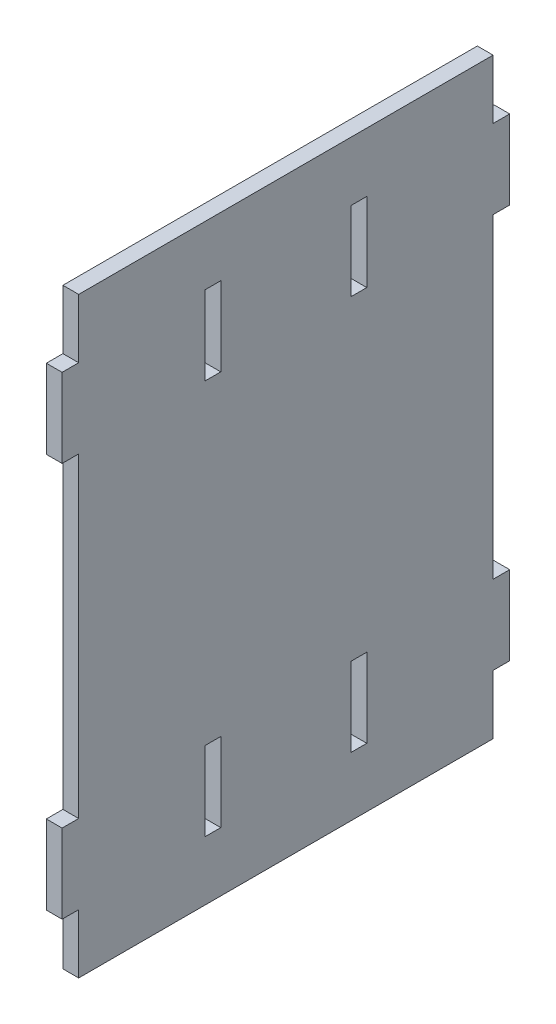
from build123d import *

# Parameters (mm, degrees)
SKETCH1_W      = 4
SKETCH1_H      = 20
EXTRUDE1_DEPTH = 4


with BuildPart() as part:
    # Sketch1 → Extrude1 (new body)
    with BuildSketch(Plane(origin=(0, 0, 0), x_dir=(0, 0, -1), z_dir=(1, 0, 0))):
        Polygon((52.5, 135), (56.7, 135), (56.7, 115), (52.5, 115), (52.5, 35), (56.7, 35), (56.7, 15), (52.5, 15), (52.5, 0), (-52.5, 0), (-52.5, 15), (-56.7, 15), (-56.7, 35), (-52.5, 35), (-52.5, 115), (-56.7, 115), (-56.7, 135), (-52.5, 135), (-52.5, 150), (52.5, 150), align=None)
        with Locations((-18.5, 125)):
            Rectangle(SKETCH1_W, SKETCH1_H, mode=Mode.SUBTRACT)
        with Locations((18.5, 125)):
            Rectangle(SKETCH1_W, SKETCH1_H, mode=Mode.SUBTRACT)
        with Locations((-18.5, 25)):
            Rectangle(SKETCH1_W, SKETCH1_H, mode=Mode.SUBTRACT)
        with Locations((18.5, 25)):
            Rectangle(SKETCH1_W, SKETCH1_H, mode=Mode.SUBTRACT)
    extrude(amount=EXTRUDE1_DEPTH)


solid = part.part
